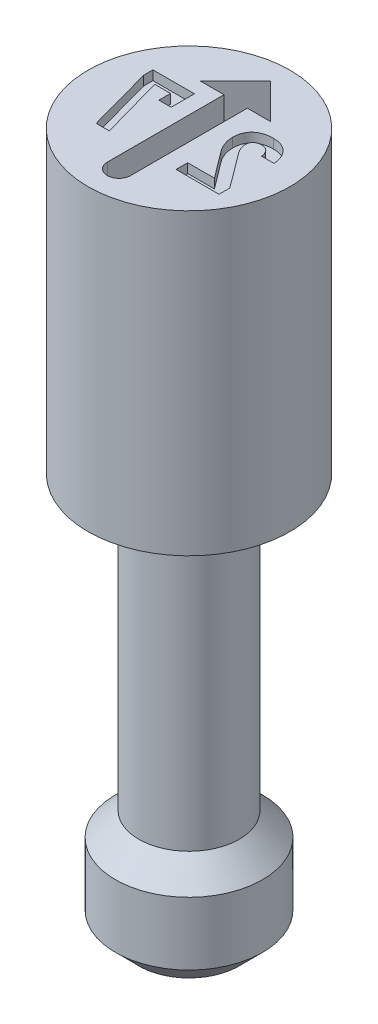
from build123d import *

# Parameters (mm, degrees)
CUT_EXTRUDE1_DEPTH = 0.4064
CUT_EXTRUDE2_DEPTH = 0.1016


with BuildPart() as part:
    # Sketch1 → Revolve1 (revolve)
    with BuildSketch(Plane.XY, mode=Mode.PRIVATE) as revolve1_sk:
        Polygon((0, 7.62), (1.09855, 7.62), (1.09855, 4.3688), (0.5461, 4.3688), (0.5461, 1.1938), (0.8, 0.9399), (0.8, 0.254), (0.546, 0), (0, 0), align=None)
    revolve(revolve1_sk.sketch.rotate(Axis((0, 0, 0), (0, 1, 0)), 90), axis=Axis((0, 0, 0), (0, 1, 0)))

    # Sketch2 → Cut-Extrude1 (cut)
    with BuildSketch(Plane(origin=(0, 7.62, 0), x_dir=(1, 0, 0), z_dir=(0, 1, 0))):
        with BuildLine():
            Line((0.127, -0.762), (0.127, 0.508))
            Line((0.127, 0.508), (0.381, 0.508))
            Line((0.381, 0.508), (0, 0.889))
            Line((0, 0.889), (-0.381, 0.508))
            Line((-0.381, 0.508), (-0.127, 0.508))
            Line((-0.127, 0.508), (-0.127, -0.762))
            ThreePointArc((-0.127, -0.762), (0, -0.889), (0.127, -0.762))
        make_face()
    extrude(amount=-CUT_EXTRUDE1_DEPTH, mode=Mode.SUBTRACT)

    # Sketch3 → Cut-Extrude2 (cut)
    with BuildSketch(Plane(origin=(0, 7.62, 0), x_dir=(1, 0, 0), z_dir=(0, 1, 0))):
        with BuildLine():
            Line((0.783814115, -0.4572), (0.783814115, -0.339931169))
            Line((0.783814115, -0.339931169), (0.503754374, 0.035461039))
            add(Edge.make_bspline(
                [(0.503754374, 0.035461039), (0.500288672, 0.040259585), (0.493454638, 0.04972186), (0.484309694, 0.064433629), (0.476606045, 0.079488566), (0.469962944, 0.094608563), (0.46475984, 0.109618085), (0.460828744, 0.124199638), (0.458660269, 0.138315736), (0.458261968, 0.1475556), (0.458067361, 0.15207013)],
                knots=[0, 0, 0, 0, 1.116221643, 2.201082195, 3.263105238, 4.303340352, 5.313368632, 6.256511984, 7.148144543, 8, 8, 8, 8], degree=3))
            Line((0.458067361, 0.15207013), (0.458067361, 0.153224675))
            add(Edge.make_bspline(
                [(0.458067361, 0.153224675), (0.458289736, 0.159747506), (0.458714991, 0.172221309), (0.463647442, 0.189681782), (0.471487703, 0.204874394), (0.482667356, 0.21744535), (0.496576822, 0.227449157), (0.513195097, 0.234666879), (0.532432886, 0.238644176), (0.546069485, 0.23919584), (0.553234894, 0.239485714)],
                knots=[0, 0, 0, 0, 1.070617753, 2.047374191, 2.957911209, 3.861726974, 4.788257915, 5.756429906, 6.821106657, 8, 8, 8, 8], degree=3))
            add(Edge.make_bspline(
                [(0.553234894, 0.239485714), (0.560094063, 0.239229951), (0.573375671, 0.23873471), (0.592228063, 0.233139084), (0.609319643, 0.224541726), (0.624047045, 0.212118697), (0.636425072, 0.196633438), (0.646237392, 0.178206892), (0.653107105, 0.15678643), (0.6555417, 0.141448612), (0.656814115, 0.133432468)],
                knots=[0, 0, 0, 0, 0.999891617, 1.936119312, 2.849186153, 3.779495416, 4.728470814, 5.731748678, 6.81452301, 8, 8, 8, 8], degree=3))
            Line((0.656814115, 0.133432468), (0.793710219, 0.132937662))
            add(Edge.make_bspline(
                [(0.793710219, 0.132937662), (0.792655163, 0.142473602), (0.790595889, 0.160120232), (0.784994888, 0.185549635), (0.778141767, 0.209463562), (0.769556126, 0.231830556), (0.759310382, 0.252618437), (0.747633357, 0.271980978), (0.7339422, 0.289452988), (0.719002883, 0.305556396), (0.702432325, 0.319709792), (0.684711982, 0.332152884), (0.665845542, 0.342776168), (0.645771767, 0.351392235), (0.624521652, 0.357950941), (0.602179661, 0.362763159), (0.578651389, 0.365569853), (0.562588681, 0.36595781), (0.554389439, 0.366155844)],
                knots=[0, 0, 0, 0, 1.176458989, 2.296231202, 3.362707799, 4.39127888, 5.389699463, 6.356664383, 7.309489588, 8.255125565, 9.192870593, 10.121896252, 11.051411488, 11.987780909, 12.941242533, 13.922967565, 14.939774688, 16, 16, 16, 16], degree=3))
            add(Edge.make_bspline(
                [(0.554389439, 0.366155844), (0.5453106, 0.366023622), (0.527661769, 0.36576659), (0.502033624, 0.363031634), (0.477961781, 0.358831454), (0.455466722, 0.352765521), (0.434593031, 0.344832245), (0.41532129, 0.335199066), (0.397525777, 0.324006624), (0.381470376, 0.310875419), (0.367132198, 0.296225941), (0.35458798, 0.280112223), (0.344233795, 0.262394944), (0.335329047, 0.243431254), (0.3288833, 0.222809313), (0.324031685, 0.20091551), (0.321255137, 0.177541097), (0.320872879, 0.161478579), (0.320676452, 0.153224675)],
                knots=[0, 0, 0, 0, 1.211483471, 2.355066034, 3.436186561, 4.470562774, 5.460097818, 6.411901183, 7.342329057, 8.260432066, 9.17382984, 10.073682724, 10.9786387, 11.907937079, 12.864144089, 13.855989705, 14.898276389, 16, 16, 16, 16], degree=3))
            add(Edge.make_bspline(
                [(0.320676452, 0.153224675), (0.320892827, 0.144414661), (0.321327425, 0.127713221), (0.32508588, 0.102584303), (0.330513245, 0.077194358), (0.33876294, 0.051909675), (0.348698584, 0.026874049), (0.360812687, 0.002658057), (0.374637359, -0.020810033), (0.385369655, -0.035490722), (0.390773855, -0.042883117)],
                knots=[0, 0, 0, 0, 0.943703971, 1.895468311, 2.880041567, 3.888955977, 4.911454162, 5.936103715, 6.960734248, 8, 8, 8, 8], degree=3))
            Line((0.390773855, -0.042883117), (0.607333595, -0.33052987))
            Line((0.607333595, -0.33052987), (0.316223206, -0.33052987))
            Line((0.316223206, -0.33052987), (0.316223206, -0.4572))
            Line((0.316223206, -0.4572), (0.783814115, -0.4572))
        make_face()
        Polygon((-0.748135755, 0.3556), (-0.748135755, 0.25498961), (-0.552687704, -0.4572), (-0.409689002, -0.4572), (-0.602168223, 0.22892987), (-0.429646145, 0.22892987), (-0.429646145, 0.10225974), (-0.296708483, 0.10225974), (-0.296708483, 0.3556), align=None)
    extrude(amount=-CUT_EXTRUDE2_DEPTH, mode=Mode.SUBTRACT)


solid = part.part
